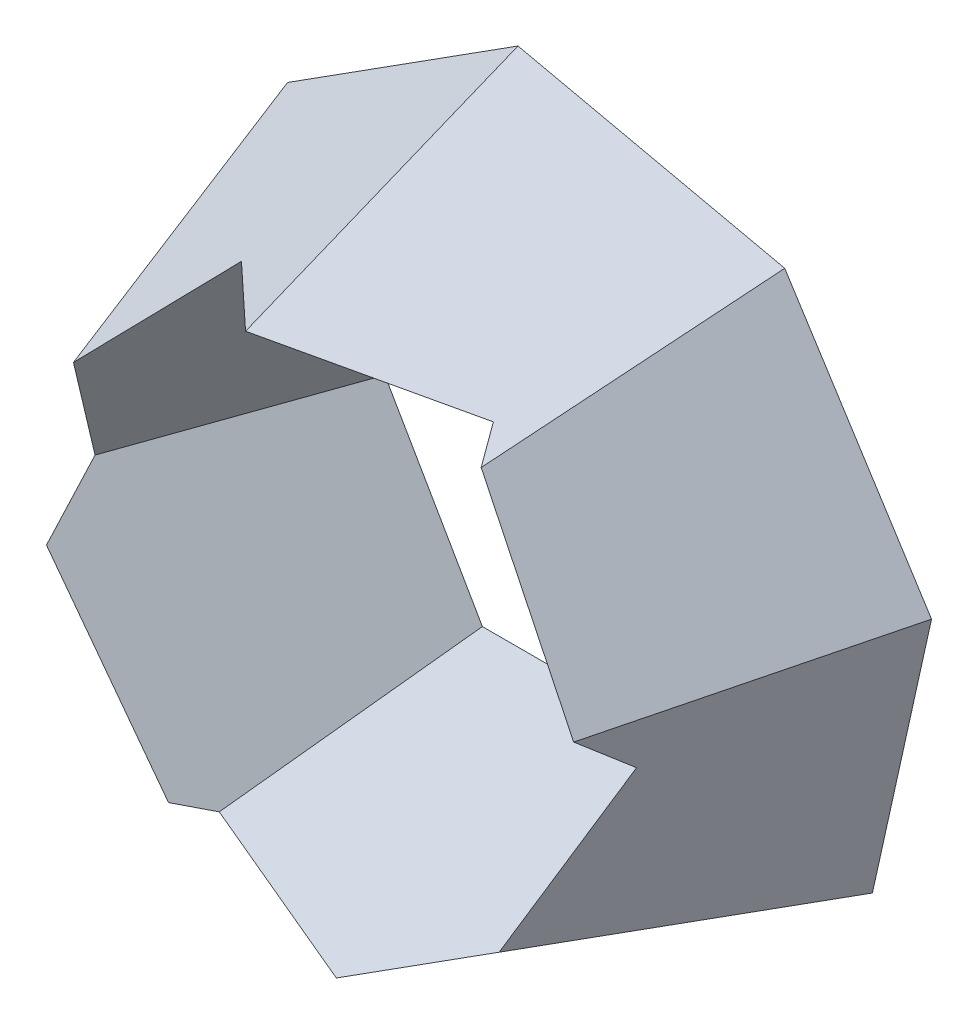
from build123d import *

# Parameters (mm, degrees)
EXTRUDE1_DEPTH = 40
EXTRUDE1_TAPER = 17


with BuildPart() as part:
    # Sketch1 → Extrude1 (new body)
    with BuildSketch(Plane.XY):
        Polygon((-37.459580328, 26.229480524), (-45.034966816, -7.940879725), (-26.229480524, -37.459580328), (7.940879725, -45.034966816), (37.459580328, -26.229480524), (45.034966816, 7.940879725), (26.229480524, 37.459580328), (-7.940879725, 45.034966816), align=None)
        Polygon((25, 0), (12.5, 21.650635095), (-12.5, 21.650635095), (-25, 0), (-12.5, -21.650635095), (12.5, -21.650635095), align=None, mode=Mode.SUBTRACT)
    extrude(amount=EXTRUDE1_DEPTH, taper=EXTRUDE1_TAPER)


solid = part.part
